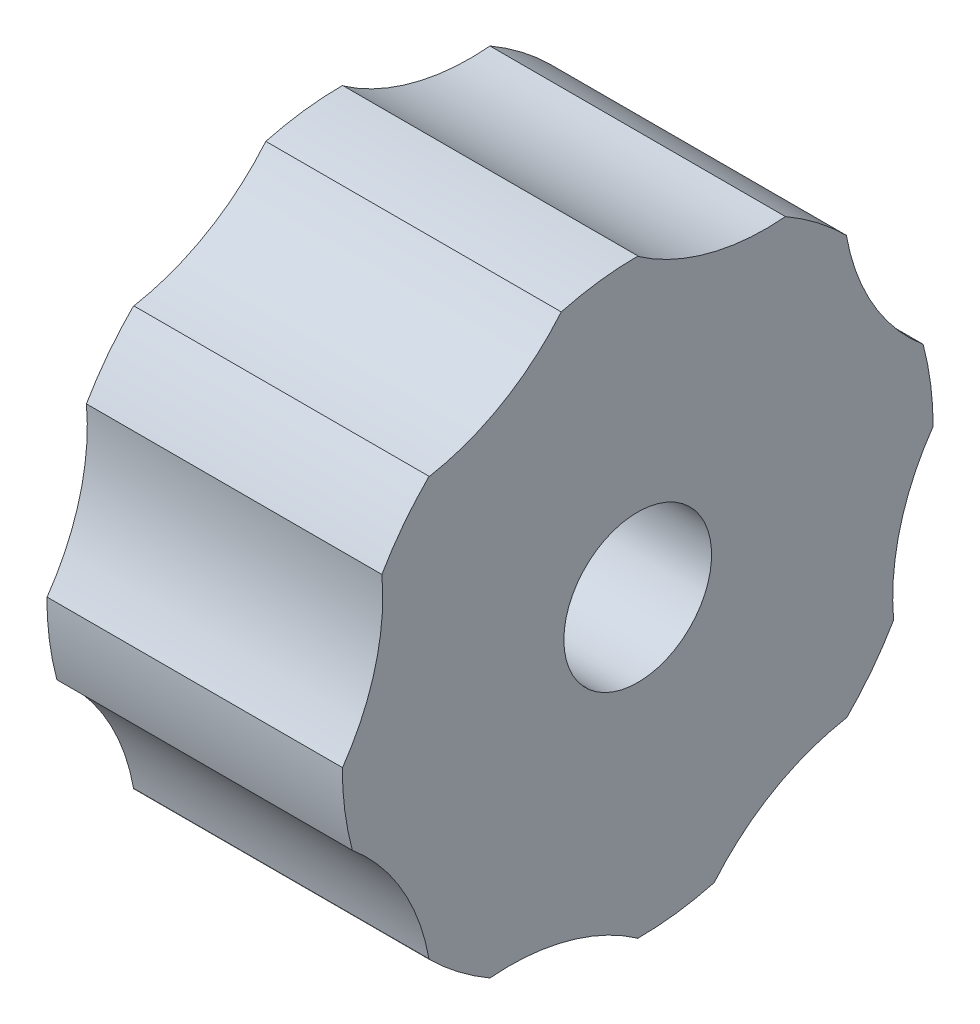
ISO-10303-21;
HEADER;
FILE_DESCRIPTION(('STEP AP214'),'2;1');
FILE_NAME('part.step','',(''),(''),'','','');
FILE_SCHEMA(('AUTOMOTIVE_DESIGN { 1 0 10303 214 1 1 1 1 }'));
ENDSEC;
DATA;
#1=APPLICATION_CONTEXT('core data for automotive mechanical design processes');
#2=APPLICATION_PROTOCOL_DEFINITION('international standard','automotive_design',2000,#1);
#3=PRODUCT_CONTEXT('',#1,'mechanical');
#4=PRODUCT('Part','Part','',(#3));
#5=PRODUCT_RELATED_PRODUCT_CATEGORY('part','',(#4));
#6=PRODUCT_DEFINITION_FORMATION('','',#4);
#7=PRODUCT_DEFINITION_CONTEXT('part definition',#1,'design');
#8=PRODUCT_DEFINITION('design','',#6,#7);
#9=PRODUCT_DEFINITION_SHAPE('','',#8);
#10=(LENGTH_UNIT() NAMED_UNIT(*) SI_UNIT(.MILLI.,.METRE.));
#11=(NAMED_UNIT(*) PLANE_ANGLE_UNIT() SI_UNIT($,.RADIAN.));
#12=(NAMED_UNIT(*) SI_UNIT($,.STERADIAN.) SOLID_ANGLE_UNIT());
#13=UNCERTAINTY_MEASURE_WITH_UNIT(LENGTH_MEASURE(1.E-05),#10,'distance_accuracy_value','');
#14=(GEOMETRIC_REPRESENTATION_CONTEXT(3) GLOBAL_UNCERTAINTY_ASSIGNED_CONTEXT((#13)) GLOBAL_UNIT_ASSIGNED_CONTEXT((#10,
#11,#12)) REPRESENTATION_CONTEXT('',''));
#15=CARTESIAN_POINT('',(0.,0.,0.));
#16=DIRECTION('',(0.,0.,1.));
#17=DIRECTION('',(1.,0.,0.));
#18=AXIS2_PLACEMENT_3D('',#15,#16,#17);
#19=CARTESIAN_POINT('',(0.,10.,0.));
#20=DIRECTION('',(-1.,0.,0.));
#21=DIRECTION('',(0.,0.,1.));
#22=AXIS2_PLACEMENT_3D('',#19,#20,#21);
#23=PLANE('',#22);
#24=CARTESIAN_POINT('',(0.,0.,0.));
#25=DIRECTION('',(-1.,0.,0.));
#26=DIRECTION('',(0.,0.,1.));
#27=AXIS2_PLACEMENT_3D('',#24,#25,#26);
#28=CIRCLE('',#27,2.5);
#29=CARTESIAN_POINT('',(0.,0.,2.5));
#30=VERTEX_POINT('',#29);
#31=EDGE_CURVE('E216',#30,#30,#28,.T.);
#32=ORIENTED_EDGE('',*,*,#31,.T.);
#33=EDGE_LOOP('',(#32));
#34=FACE_BOUND('',#33,.T.);
#35=CARTESIAN_POINT('',(0.,6.51014151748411,3.75411292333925));
#36=DIRECTION('',(1.,0.,0.));
#37=DIRECTION('',(0.,-0.707106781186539,0.707106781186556));
#38=AXIS2_PLACEMENT_3D('',#35,#36,#37);
#39=CIRCLE('',#38,3.35802196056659);
#40=CARTESIAN_POINT('',(0.,7.07842879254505,7.06369916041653));
#41=VERTEX_POINT('',#40);
#42=CARTESIAN_POINT('',(0.,7.06583669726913,7.06583669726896));
#43=VERTEX_POINT('',#42);
#44=EDGE_CURVE('E192',#41,#43,#39,.T.);
#45=ORIENTED_EDGE('',*,*,#44,.F.);
#46=CARTESIAN_POINT('',(0.,0.,0.));
#47=DIRECTION('',(-1.,0.,0.));
#48=DIRECTION('',(0.,0.,1.));
#49=AXIS2_PLACEMENT_3D('',#46,#47,#48);
#50=CIRCLE('',#49,10.);
#51=CARTESIAN_POINT('',(0.,5.0000000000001,8.66025403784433));
#52=VERTEX_POINT('',#51);
#53=EDGE_CURVE('E356',#52,#41,#50,.T.);
#54=ORIENTED_EDGE('',*,*,#53,.F.);
#55=CARTESIAN_POINT('',(0.,4.33132225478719,16.1989650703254));
#56=DIRECTION('',(1.,0.,0.));
#57=DIRECTION('',(0.,1.,0.));
#58=AXIS2_PLACEMENT_3D('',#55,#56,#57);
#59=CIRCLE('',#58,7.56830852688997);
#60=CARTESIAN_POINT('',(0.,1.03799650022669E-13,9.9926020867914));
#61=VERTEX_POINT('',#60);
#62=EDGE_CURVE('E53',#61,#52,#59,.T.);
#63=ORIENTED_EDGE('',*,*,#62,.F.);
#64=CARTESIAN_POINT('',(0.,1.94880650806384,7.25792391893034));
#65=DIRECTION('',(1.,0.,0.));
#66=DIRECTION('',(0.,-1.,0.));
#67=AXIS2_PLACEMENT_3D('',#64,#65,#66);
#68=CIRCLE('',#67,3.35802196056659);
#69=CARTESIAN_POINT('',(0.,0.0104154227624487,9.99999457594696));
#70=VERTEX_POINT('',#69);
#71=EDGE_CURVE('E218',#70,#61,#68,.T.);
#72=ORIENTED_EDGE('',*,*,#71,.F.);
#73=CARTESIAN_POINT('',(0.,-2.58819045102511,9.65925826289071));
#74=VERTEX_POINT('',#73);
#75=EDGE_CURVE('E352',#74,#70,#50,.T.);
#76=ORIENTED_EDGE('',*,*,#75,.F.);
#77=CARTESIAN_POINT('',(0.,-8.39169071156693,14.5171053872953));
#78=DIRECTION('',(1.,0.,0.));
#79=DIRECTION('',(0.,0.707106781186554,0.707106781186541));
#80=AXIS2_PLACEMENT_3D('',#77,#78,#79);
#81=CIRCLE('',#80,7.56830852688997);
#82=CARTESIAN_POINT('',(0.,-7.06583669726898,7.0658366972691));
#83=VERTEX_POINT('',#82);
#84=EDGE_CURVE('E234',#83,#74,#81,.T.);
#85=ORIENTED_EDGE('',*,*,#84,.F.);
#86=CARTESIAN_POINT('',(0.,-3.75411292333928,6.5101415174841));
#87=DIRECTION('',(1.,0.,0.));
#88=DIRECTION('',(0.,-0.707106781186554,-0.707106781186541));
#89=AXIS2_PLACEMENT_3D('',#86,#87,#88);
#90=CIRCLE('',#89,3.35802196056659);
#91=CARTESIAN_POINT('',(0.,-7.06369916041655,7.07842879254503));
#92=VERTEX_POINT('',#91);
#93=EDGE_CURVE('E232',#92,#83,#90,.T.);
#94=ORIENTED_EDGE('',*,*,#93,.F.);
#95=CARTESIAN_POINT('',(0.,-8.66025403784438,5.00000000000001));
#96=VERTEX_POINT('',#95);
#97=EDGE_CURVE('E355',#96,#92,#50,.T.);
#98=ORIENTED_EDGE('',*,*,#97,.F.);
#99=CARTESIAN_POINT('',(0.,-16.1989650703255,4.33132225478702));
#100=DIRECTION('',(1.,0.,0.));
#101=DIRECTION('',(0.,0.,1.));
#102=AXIS2_PLACEMENT_3D('',#99,#100,#101);
#103=CIRCLE('',#102,7.56830852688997);
#104=CARTESIAN_POINT('',(0.,-9.9926020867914,0.));
#105=VERTEX_POINT('',#104);
#106=EDGE_CURVE('E249',#105,#96,#103,.T.);
#107=ORIENTED_EDGE('',*,*,#106,.F.);
#108=CARTESIAN_POINT('',(0.,-7.25792391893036,1.94880650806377));
#109=DIRECTION('',(1.,0.,0.));
#110=DIRECTION('',(0.,0.,-1.));
#111=AXIS2_PLACEMENT_3D('',#108,#109,#110);
#112=CIRCLE('',#111,3.35802196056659);
#113=CARTESIAN_POINT('',(0.,-9.99999457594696,0.0104154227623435));
#114=VERTEX_POINT('',#113);
#115=EDGE_CURVE('E247',#114,#105,#112,.T.);
#116=ORIENTED_EDGE('',*,*,#115,.F.);
#117=CARTESIAN_POINT('',(0.,-9.6592582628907,-2.58819045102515));
#118=VERTEX_POINT('',#117);
#119=EDGE_CURVE('E358',#118,#114,#50,.T.);
#120=ORIENTED_EDGE('',*,*,#119,.F.);
#121=CARTESIAN_POINT('',(0.,-14.5171053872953,-8.39169071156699));
#122=DIRECTION('',(1.,0.,0.));
#123=DIRECTION('',(0.,-0.707106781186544,0.707106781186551));
#124=AXIS2_PLACEMENT_3D('',#121,#122,#123);
#125=CIRCLE('',#124,7.56830852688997);
#126=CARTESIAN_POINT('',(0.,-7.06583669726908,-7.06583669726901));
#127=VERTEX_POINT('',#126);
#128=EDGE_CURVE('E264',#127,#118,#125,.T.);
#129=ORIENTED_EDGE('',*,*,#128,.F.);
#130=CARTESIAN_POINT('',(0.,-6.51014151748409,-3.7541129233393));
#131=DIRECTION('',(1.,0.,0.));
#132=DIRECTION('',(0.,0.707106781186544,-0.707106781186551));
#133=AXIS2_PLACEMENT_3D('',#130,#131,#132);
#134=CIRCLE('',#133,3.35802196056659);
#135=CARTESIAN_POINT('',(0.,-7.07842879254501,-7.06369916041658));
#136=VERTEX_POINT('',#135);
#137=EDGE_CURVE('E262',#136,#127,#134,.T.);
#138=ORIENTED_EDGE('',*,*,#137,.F.);
#139=CARTESIAN_POINT('',(0.,-5.00000000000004,-8.66025403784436));
#140=VERTEX_POINT('',#139);
#141=EDGE_CURVE('E410',#140,#136,#50,.T.);
#142=ORIENTED_EDGE('',*,*,#141,.F.);
#143=CARTESIAN_POINT('',(0.,-4.33132225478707,-16.1989650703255));
#144=DIRECTION('',(1.,0.,0.));
#145=DIRECTION('',(0.,-1.,0.));
#146=AXIS2_PLACEMENT_3D('',#143,#144,#145);
#147=CIRCLE('',#146,7.56830852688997);
#148=CARTESIAN_POINT('',(0.,0.,-9.9926020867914));
#149=VERTEX_POINT('',#148);
#150=EDGE_CURVE('E279',#149,#140,#147,.T.);
#151=ORIENTED_EDGE('',*,*,#150,.F.);
#152=CARTESIAN_POINT('',(0.,-1.94880650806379,-7.25792391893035));
#153=DIRECTION('',(1.,0.,0.));
#154=DIRECTION('',(0.,1.,0.));
#155=AXIS2_PLACEMENT_3D('',#152,#153,#154);
#156=CIRCLE('',#155,3.35802196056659);
#157=CARTESIAN_POINT('',(0.,-0.0104154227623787,-9.99999457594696));
#158=VERTEX_POINT('',#157);
#159=EDGE_CURVE('E277',#158,#149,#156,.T.);
#160=ORIENTED_EDGE('',*,*,#159,.F.);
#161=CARTESIAN_POINT('',(0.,2.58819045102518,-9.65925826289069));
#162=VERTEX_POINT('',#161);
#163=EDGE_CURVE('E325',#162,#158,#50,.T.);
#164=ORIENTED_EDGE('',*,*,#163,.F.);
#165=CARTESIAN_POINT('',(0.,8.39169071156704,-14.5171053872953));
#166=DIRECTION('',(1.,0.,0.));
#167=DIRECTION('',(0.,-0.707106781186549,-0.707106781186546));
#168=AXIS2_PLACEMENT_3D('',#165,#166,#167);
#169=CIRCLE('',#168,7.56830852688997);
#170=CARTESIAN_POINT('',(0.,7.06583669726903,-7.06583669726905));
#171=VERTEX_POINT('',#170);
#172=EDGE_CURVE('E294',#171,#162,#169,.T.);
#173=ORIENTED_EDGE('',*,*,#172,.F.);
#174=CARTESIAN_POINT('',(0.,3.75411292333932,-6.51014151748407));
#175=DIRECTION('',(1.,0.,0.));
#176=DIRECTION('',(0.,0.707106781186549,0.707106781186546));
#177=AXIS2_PLACEMENT_3D('',#174,#175,#176);
#178=CIRCLE('',#177,3.35802196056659);
#179=CARTESIAN_POINT('',(0.,7.0636991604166,-7.07842879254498));
#180=VERTEX_POINT('',#179);
#181=EDGE_CURVE('E292',#180,#171,#178,.T.);
#182=ORIENTED_EDGE('',*,*,#181,.F.);
#183=CARTESIAN_POINT('',(0.,8.66025403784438,-5.00000000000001));
#184=VERTEX_POINT('',#183);
#185=EDGE_CURVE('E321',#184,#180,#50,.T.);
#186=ORIENTED_EDGE('',*,*,#185,.F.);
#187=CARTESIAN_POINT('',(0.,16.1989650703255,-4.33132225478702));
#188=DIRECTION('',(1.,0.,0.));
#189=DIRECTION('',(0.,0.,-1.));
#190=AXIS2_PLACEMENT_3D('',#187,#188,#189);
#191=CIRCLE('',#190,7.56830852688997);
#192=CARTESIAN_POINT('',(0.,9.9926020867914,0.));
#193=VERTEX_POINT('',#192);
#194=EDGE_CURVE('E309',#193,#184,#191,.T.);
#195=ORIENTED_EDGE('',*,*,#194,.F.);
#196=CARTESIAN_POINT('',(0.,7.25792391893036,-1.94880650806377));
#197=DIRECTION('',(1.,0.,0.));
#198=DIRECTION('',(0.,0.,1.));
#199=AXIS2_PLACEMENT_3D('',#196,#197,#198);
#200=CIRCLE('',#199,3.35802196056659);
#201=CARTESIAN_POINT('',(0.,9.99999457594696,-0.0104154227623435));
#202=VERTEX_POINT('',#201);
#203=EDGE_CURVE('E307',#202,#193,#200,.T.);
#204=ORIENTED_EDGE('',*,*,#203,.F.);
#205=CARTESIAN_POINT('',(0.,9.65925826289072,2.58819045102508));
#206=VERTEX_POINT('',#205);
#207=EDGE_CURVE('E209',#206,#202,#50,.T.);
#208=ORIENTED_EDGE('',*,*,#207,.F.);
#209=CARTESIAN_POINT('',(0.,14.5171053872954,8.39169071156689));
#210=DIRECTION('',(1.,0.,0.));
#211=DIRECTION('',(0.,0.707106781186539,-0.707106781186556));
#212=AXIS2_PLACEMENT_3D('',#209,#210,#211);
#213=CIRCLE('',#212,7.56830852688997);
#214=EDGE_CURVE('E45',#43,#206,#213,.T.);
#215=ORIENTED_EDGE('',*,*,#214,.F.);
#216=EDGE_LOOP('',(#45,#54,#63,#72,#76,#85,#94,#98,#107,#116,#120,#129,#138,#142,#151,#160,#164,
#173,#182,#186,#195,#204,#208,#215));
#217=FACE_BOUND('',#216,.T.);
#218=ADVANCED_FACE('F31',(#34,#217),#23,.F.);
#219=CARTESIAN_POINT('',(-10.,3.,0.));
#220=DIRECTION('',(1.,0.,0.));
#221=DIRECTION('',(0.,0.,-1.));
#222=AXIS2_PLACEMENT_3D('',#219,#220,#221);
#223=PLANE('',#222);
#224=CARTESIAN_POINT('',(-10.,0.,0.));
#225=DIRECTION('',(-1.,0.,0.));
#226=DIRECTION('',(0.,0.,1.));
#227=AXIS2_PLACEMENT_3D('',#224,#225,#226);
#228=CIRCLE('',#227,2.5);
#229=CARTESIAN_POINT('',(-10.,0.,2.5));
#230=VERTEX_POINT('',#229);
#231=EDGE_CURVE('E468',#230,#230,#228,.T.);
#232=ORIENTED_EDGE('',*,*,#231,.F.);
#233=EDGE_LOOP('',(#232));
#234=FACE_BOUND('',#233,.T.);
#235=CARTESIAN_POINT('',(-10.,6.51014151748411,3.75411292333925));
#236=DIRECTION('',(1.,0.,0.));
#237=DIRECTION('',(0.,-0.707106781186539,0.707106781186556));
#238=AXIS2_PLACEMENT_3D('',#235,#236,#237);
#239=CIRCLE('',#238,3.35802196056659);
#240=CARTESIAN_POINT('',(-10.,7.07842879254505,7.06369916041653));
#241=VERTEX_POINT('',#240);
#242=CARTESIAN_POINT('',(-10.,7.06583669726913,7.06583669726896));
#243=VERTEX_POINT('',#242);
#244=EDGE_CURVE('E214',#241,#243,#239,.T.);
#245=ORIENTED_EDGE('',*,*,#244,.T.);
#246=CARTESIAN_POINT('',(-10.,14.5171053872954,8.39169071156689));
#247=DIRECTION('',(1.,0.,0.));
#248=DIRECTION('',(0.,0.707106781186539,-0.707106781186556));
#249=AXIS2_PLACEMENT_3D('',#246,#247,#248);
#250=CIRCLE('',#249,7.56830852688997);
#251=CARTESIAN_POINT('',(-10.,9.65925826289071,2.58819045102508));
#252=VERTEX_POINT('',#251);
#253=EDGE_CURVE('E200',#243,#252,#250,.T.);
#254=ORIENTED_EDGE('',*,*,#253,.T.);
#255=CARTESIAN_POINT('',(-10.,0.,0.));
#256=DIRECTION('',(-1.,0.,0.));
#257=DIRECTION('',(0.,0.,1.));
#258=AXIS2_PLACEMENT_3D('',#255,#256,#257);
#259=CIRCLE('',#258,10.);
#260=CARTESIAN_POINT('',(-10.,9.99999457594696,-0.0104154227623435));
#261=VERTEX_POINT('',#260);
#262=EDGE_CURVE('E324',#252,#261,#259,.T.);
#263=ORIENTED_EDGE('',*,*,#262,.T.);
#264=CARTESIAN_POINT('',(-10.,7.25792391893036,-1.94880650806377));
#265=DIRECTION('',(1.,0.,0.));
#266=DIRECTION('',(0.,0.,1.));
#267=AXIS2_PLACEMENT_3D('',#264,#265,#266);
#268=CIRCLE('',#267,3.35802196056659);
#269=CARTESIAN_POINT('',(-10.,9.9926020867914,0.));
#270=VERTEX_POINT('',#269);
#271=EDGE_CURVE('E306',#261,#270,#268,.T.);
#272=ORIENTED_EDGE('',*,*,#271,.T.);
#273=CARTESIAN_POINT('',(-10.,16.1989650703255,-4.33132225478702));
#274=DIRECTION('',(1.,0.,0.));
#275=DIRECTION('',(0.,0.,-1.));
#276=AXIS2_PLACEMENT_3D('',#273,#274,#275);
#277=CIRCLE('',#276,7.56830852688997);
#278=CARTESIAN_POINT('',(-10.,8.66025403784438,-5.00000000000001));
#279=VERTEX_POINT('',#278);
#280=EDGE_CURVE('E310',#270,#279,#277,.T.);
#281=ORIENTED_EDGE('',*,*,#280,.T.);
#282=CARTESIAN_POINT('',(-10.,7.0636991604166,-7.07842879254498));
#283=VERTEX_POINT('',#282);
#284=EDGE_CURVE('E326',#279,#283,#259,.T.);
#285=ORIENTED_EDGE('',*,*,#284,.T.);
#286=CARTESIAN_POINT('',(-10.,3.75411292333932,-6.51014151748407));
#287=DIRECTION('',(1.,0.,0.));
#288=DIRECTION('',(0.,0.707106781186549,0.707106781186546));
#289=AXIS2_PLACEMENT_3D('',#286,#287,#288);
#290=CIRCLE('',#289,3.35802196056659);
#291=CARTESIAN_POINT('',(-10.,7.06583669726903,-7.06583669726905));
#292=VERTEX_POINT('',#291);
#293=EDGE_CURVE('E291',#283,#292,#290,.T.);
#294=ORIENTED_EDGE('',*,*,#293,.T.);
#295=CARTESIAN_POINT('',(-10.,8.39169071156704,-14.5171053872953));
#296=DIRECTION('',(1.,0.,0.));
#297=DIRECTION('',(0.,-0.707106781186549,-0.707106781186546));
#298=AXIS2_PLACEMENT_3D('',#295,#296,#297);
#299=CIRCLE('',#298,7.56830852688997);
#300=CARTESIAN_POINT('',(-10.,2.58819045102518,-9.65925826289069));
#301=VERTEX_POINT('',#300);
#302=EDGE_CURVE('E295',#292,#301,#299,.T.);
#303=ORIENTED_EDGE('',*,*,#302,.T.);
#304=CARTESIAN_POINT('',(-10.,-0.0104154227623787,-9.99999457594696));
#305=VERTEX_POINT('',#304);
#306=EDGE_CURVE('E330',#301,#305,#259,.T.);
#307=ORIENTED_EDGE('',*,*,#306,.T.);
#308=CARTESIAN_POINT('',(-10.,-1.94880650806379,-7.25792391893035));
#309=DIRECTION('',(1.,0.,0.));
#310=DIRECTION('',(0.,1.,0.));
#311=AXIS2_PLACEMENT_3D('',#308,#309,#310);
#312=CIRCLE('',#311,3.35802196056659);
#313=CARTESIAN_POINT('',(-10.,0.,-9.9926020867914));
#314=VERTEX_POINT('',#313);
#315=EDGE_CURVE('E276',#305,#314,#312,.T.);
#316=ORIENTED_EDGE('',*,*,#315,.T.);
#317=CARTESIAN_POINT('',(-10.,-4.33132225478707,-16.1989650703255));
#318=DIRECTION('',(1.,0.,0.));
#319=DIRECTION('',(0.,-1.,0.));
#320=AXIS2_PLACEMENT_3D('',#317,#318,#319);
#321=CIRCLE('',#320,7.56830852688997);
#322=CARTESIAN_POINT('',(-10.,-5.00000000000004,-8.66025403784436));
#323=VERTEX_POINT('',#322);
#324=EDGE_CURVE('E280',#314,#323,#321,.T.);
#325=ORIENTED_EDGE('',*,*,#324,.T.);
#326=CARTESIAN_POINT('',(-10.,-7.07842879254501,-7.06369916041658));
#327=VERTEX_POINT('',#326);
#328=EDGE_CURVE('E389',#323,#327,#259,.T.);
#329=ORIENTED_EDGE('',*,*,#328,.T.);
#330=CARTESIAN_POINT('',(-10.,-6.51014151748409,-3.7541129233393));
#331=DIRECTION('',(1.,0.,0.));
#332=DIRECTION('',(0.,0.707106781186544,-0.707106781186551));
#333=AXIS2_PLACEMENT_3D('',#330,#331,#332);
#334=CIRCLE('',#333,3.35802196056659);
#335=CARTESIAN_POINT('',(-10.,-7.06583669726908,-7.06583669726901));
#336=VERTEX_POINT('',#335);
#337=EDGE_CURVE('E261',#327,#336,#334,.T.);
#338=ORIENTED_EDGE('',*,*,#337,.T.);
#339=CARTESIAN_POINT('',(-10.,-14.5171053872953,-8.39169071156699));
#340=DIRECTION('',(1.,0.,0.));
#341=DIRECTION('',(0.,-0.707106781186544,0.707106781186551));
#342=AXIS2_PLACEMENT_3D('',#339,#340,#341);
#343=CIRCLE('',#342,7.56830852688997);
#344=CARTESIAN_POINT('',(-10.,-9.6592582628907,-2.58819045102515));
#345=VERTEX_POINT('',#344);
#346=EDGE_CURVE('E265',#336,#345,#343,.T.);
#347=ORIENTED_EDGE('',*,*,#346,.T.);
#348=CARTESIAN_POINT('',(-10.,-9.99999457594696,0.0104154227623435));
#349=VERTEX_POINT('',#348);
#350=EDGE_CURVE('E386',#345,#349,#259,.T.);
#351=ORIENTED_EDGE('',*,*,#350,.T.);
#352=CARTESIAN_POINT('',(-10.,-7.25792391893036,1.94880650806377));
#353=DIRECTION('',(1.,0.,0.));
#354=DIRECTION('',(0.,0.,-1.));
#355=AXIS2_PLACEMENT_3D('',#352,#353,#354);
#356=CIRCLE('',#355,3.35802196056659);
#357=CARTESIAN_POINT('',(-10.,-9.9926020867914,0.));
#358=VERTEX_POINT('',#357);
#359=EDGE_CURVE('E246',#349,#358,#356,.T.);
#360=ORIENTED_EDGE('',*,*,#359,.T.);
#361=CARTESIAN_POINT('',(-10.,-16.1989650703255,4.33132225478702));
#362=DIRECTION('',(1.,0.,0.));
#363=DIRECTION('',(0.,0.,1.));
#364=AXIS2_PLACEMENT_3D('',#361,#362,#363);
#365=CIRCLE('',#364,7.56830852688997);
#366=CARTESIAN_POINT('',(-10.,-8.66025403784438,5.00000000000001));
#367=VERTEX_POINT('',#366);
#368=EDGE_CURVE('E250',#358,#367,#365,.T.);
#369=ORIENTED_EDGE('',*,*,#368,.T.);
#370=CARTESIAN_POINT('',(-10.,-7.06369916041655,7.07842879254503));
#371=VERTEX_POINT('',#370);
#372=EDGE_CURVE('E384',#367,#371,#259,.T.);
#373=ORIENTED_EDGE('',*,*,#372,.T.);
#374=CARTESIAN_POINT('',(-10.,-3.75411292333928,6.5101415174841));
#375=DIRECTION('',(1.,0.,0.));
#376=DIRECTION('',(0.,-0.707106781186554,-0.707106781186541));
#377=AXIS2_PLACEMENT_3D('',#374,#375,#376);
#378=CIRCLE('',#377,3.35802196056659);
#379=CARTESIAN_POINT('',(-10.,-7.06583669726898,7.0658366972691));
#380=VERTEX_POINT('',#379);
#381=EDGE_CURVE('E231',#371,#380,#378,.T.);
#382=ORIENTED_EDGE('',*,*,#381,.T.);
#383=CARTESIAN_POINT('',(-10.,-8.39169071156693,14.5171053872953));
#384=DIRECTION('',(1.,0.,0.));
#385=DIRECTION('',(0.,0.707106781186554,0.707106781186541));
#386=AXIS2_PLACEMENT_3D('',#383,#384,#385);
#387=CIRCLE('',#386,7.56830852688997);
#388=CARTESIAN_POINT('',(-10.,-2.58819045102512,9.65925826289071));
#389=VERTEX_POINT('',#388);
#390=EDGE_CURVE('E235',#380,#389,#387,.T.);
#391=ORIENTED_EDGE('',*,*,#390,.T.);
#392=CARTESIAN_POINT('',(-10.,0.0104154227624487,9.99999457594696));
#393=VERTEX_POINT('',#392);
#394=EDGE_CURVE('E382',#389,#393,#259,.T.);
#395=ORIENTED_EDGE('',*,*,#394,.T.);
#396=CARTESIAN_POINT('',(-10.,1.94880650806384,7.25792391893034));
#397=DIRECTION('',(1.,0.,0.));
#398=DIRECTION('',(0.,-1.,0.));
#399=AXIS2_PLACEMENT_3D('',#396,#397,#398);
#400=CIRCLE('',#399,3.35802196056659);
#401=CARTESIAN_POINT('',(-10.,1.03799650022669E-13,9.9926020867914));
#402=VERTEX_POINT('',#401);
#403=EDGE_CURVE('E204',#393,#402,#400,.T.);
#404=ORIENTED_EDGE('',*,*,#403,.T.);
#405=CARTESIAN_POINT('',(-10.,4.33132225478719,16.1989650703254));
#406=DIRECTION('',(1.,0.,0.));
#407=DIRECTION('',(0.,1.,0.));
#408=AXIS2_PLACEMENT_3D('',#405,#406,#407);
#409=CIRCLE('',#408,7.56830852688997);
#410=CARTESIAN_POINT('',(-10.,5.0000000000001,8.66025403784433));
#411=VERTEX_POINT('',#410);
#412=EDGE_CURVE('E220',#402,#411,#409,.T.);
#413=ORIENTED_EDGE('',*,*,#412,.T.);
#414=EDGE_CURVE('E380',#411,#241,#259,.T.);
#415=ORIENTED_EDGE('',*,*,#414,.T.);
#416=EDGE_LOOP('',(#245,#254,#263,#272,#281,#285,#294,#303,#307,#316,#325,#329,#338,#347,#351,
#360,#369,#373,#382,#391,#395,#404,#413,#415));
#417=FACE_BOUND('',#416,.T.);
#418=ADVANCED_FACE('F379',(#234,#417),#223,.F.);
#419=CARTESIAN_POINT('',(0.,0.,0.));
#420=DIRECTION('',(-1.,0.,0.));
#421=DIRECTION('',(0.,0.,1.));
#422=AXIS2_PLACEMENT_3D('',#419,#420,#421);
#423=CYLINDRICAL_SURFACE('',#422,10.);
#424=DIRECTION('',(-1.,0.,0.));
#425=VECTOR('',#424,1.);
#426=CARTESIAN_POINT('',(-5.,7.07842879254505,7.06369916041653));
#427=LINE('',#426,#425);
#428=EDGE_CURVE('E11',#241,#41,#427,.F.);
#429=ORIENTED_EDGE('',*,*,#428,.F.);
#430=ORIENTED_EDGE('',*,*,#414,.F.);
#431=DIRECTION('',(-1.,0.,0.));
#432=VECTOR('',#431,1.);
#433=CARTESIAN_POINT('',(0.,5.0000000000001,8.66025403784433));
#434=LINE('',#433,#432);
#435=EDGE_CURVE('E222',#52,#411,#434,.T.);
#436=ORIENTED_EDGE('',*,*,#435,.F.);
#437=ORIENTED_EDGE('',*,*,#53,.T.);
#438=EDGE_LOOP('',(#429,#430,#436,#437));
#439=FACE_BOUND('',#438,.T.);
#440=ADVANCED_FACE('F463',(#439),#423,.T.);
#441=DIRECTION('',(-1.,0.,0.));
#442=VECTOR('',#441,1.);
#443=CARTESIAN_POINT('',(0.,9.65925826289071,2.58819045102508));
#444=LINE('',#443,#442);
#445=EDGE_CURVE('E205',#206,#252,#444,.T.);
#446=ORIENTED_EDGE('',*,*,#445,.F.);
#447=ORIENTED_EDGE('',*,*,#207,.T.);
#448=DIRECTION('',(-1.,0.,0.));
#449=VECTOR('',#448,1.);
#450=CARTESIAN_POINT('',(-5.,9.99999457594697,-0.0104154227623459));
#451=LINE('',#450,#449);
#452=EDGE_CURVE('E329',#261,#202,#451,.F.);
#453=ORIENTED_EDGE('',*,*,#452,.F.);
#454=ORIENTED_EDGE('',*,*,#262,.F.);
#455=EDGE_LOOP('',(#446,#447,#453,#454));
#456=FACE_BOUND('',#455,.T.);
#457=ADVANCED_FACE('F362',(#456),#423,.T.);
#458=DIRECTION('',(-1.,0.,0.));
#459=VECTOR('',#458,1.);
#460=CARTESIAN_POINT('',(-5.,0.0104154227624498,9.99999457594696));
#461=LINE('',#460,#459);
#462=EDGE_CURVE('E38',#393,#70,#461,.F.);
#463=ORIENTED_EDGE('',*,*,#462,.F.);
#464=ORIENTED_EDGE('',*,*,#394,.F.);
#465=DIRECTION('',(-1.,0.,0.));
#466=VECTOR('',#465,1.);
#467=CARTESIAN_POINT('',(0.,-2.58819045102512,9.65925826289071));
#468=LINE('',#467,#466);
#469=EDGE_CURVE('E237',#74,#389,#468,.T.);
#470=ORIENTED_EDGE('',*,*,#469,.F.);
#471=ORIENTED_EDGE('',*,*,#75,.T.);
#472=EDGE_LOOP('',(#463,#464,#470,#471));
#473=FACE_BOUND('',#472,.T.);
#474=ADVANCED_FACE('F354',(#473),#423,.T.);
#475=DIRECTION('',(-1.,0.,0.));
#476=VECTOR('',#475,1.);
#477=CARTESIAN_POINT('',(-5.,-7.06369916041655,7.07842879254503));
#478=LINE('',#477,#476);
#479=EDGE_CURVE('E341',#371,#92,#478,.F.);
#480=ORIENTED_EDGE('',*,*,#479,.F.);
#481=ORIENTED_EDGE('',*,*,#372,.F.);
#482=DIRECTION('',(-1.,0.,0.));
#483=VECTOR('',#482,1.);
#484=CARTESIAN_POINT('',(0.,-8.66025403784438,5.00000000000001));
#485=LINE('',#484,#483);
#486=EDGE_CURVE('E252',#96,#367,#485,.T.);
#487=ORIENTED_EDGE('',*,*,#486,.F.);
#488=ORIENTED_EDGE('',*,*,#97,.T.);
#489=EDGE_LOOP('',(#480,#481,#487,#488));
#490=FACE_BOUND('',#489,.T.);
#491=ADVANCED_FACE('F441',(#490),#423,.T.);
#492=DIRECTION('',(-1.,0.,0.));
#493=VECTOR('',#492,1.);
#494=CARTESIAN_POINT('',(-5.,-9.99999457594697,0.0104154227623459));
#495=LINE('',#494,#493);
#496=EDGE_CURVE('E339',#349,#114,#495,.F.);
#497=ORIENTED_EDGE('',*,*,#496,.F.);
#498=ORIENTED_EDGE('',*,*,#350,.F.);
#499=DIRECTION('',(-1.,0.,0.));
#500=VECTOR('',#499,1.);
#501=CARTESIAN_POINT('',(0.,-9.6592582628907,-2.58819045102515));
#502=LINE('',#501,#500);
#503=EDGE_CURVE('E267',#118,#345,#502,.T.);
#504=ORIENTED_EDGE('',*,*,#503,.F.);
#505=ORIENTED_EDGE('',*,*,#119,.T.);
#506=EDGE_LOOP('',(#497,#498,#504,#505));
#507=FACE_BOUND('',#506,.T.);
#508=ADVANCED_FACE('F429',(#507),#423,.T.);
#509=DIRECTION('',(-1.,0.,0.));
#510=VECTOR('',#509,1.);
#511=CARTESIAN_POINT('',(-5.,-7.078428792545,-7.06369916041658));
#512=LINE('',#511,#510);
#513=EDGE_CURVE('E337',#327,#136,#512,.F.);
#514=ORIENTED_EDGE('',*,*,#513,.F.);
#515=ORIENTED_EDGE('',*,*,#328,.F.);
#516=DIRECTION('',(-1.,0.,0.));
#517=VECTOR('',#516,1.);
#518=CARTESIAN_POINT('',(0.,-5.00000000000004,-8.66025403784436));
#519=LINE('',#518,#517);
#520=EDGE_CURVE('E282',#140,#323,#519,.T.);
#521=ORIENTED_EDGE('',*,*,#520,.F.);
#522=ORIENTED_EDGE('',*,*,#141,.T.);
#523=EDGE_LOOP('',(#514,#515,#521,#522));
#524=FACE_BOUND('',#523,.T.);
#525=ADVANCED_FACE('F416',(#524),#423,.T.);
#526=DIRECTION('',(-1.,0.,0.));
#527=VECTOR('',#526,1.);
#528=CARTESIAN_POINT('',(-5.,-0.0104154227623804,-9.99999457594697));
#529=LINE('',#528,#527);
#530=EDGE_CURVE('E335',#305,#158,#529,.F.);
#531=ORIENTED_EDGE('',*,*,#530,.F.);
#532=ORIENTED_EDGE('',*,*,#306,.F.);
#533=DIRECTION('',(-1.,0.,0.));
#534=VECTOR('',#533,1.);
#535=CARTESIAN_POINT('',(0.,2.58819045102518,-9.65925826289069));
#536=LINE('',#535,#534);
#537=EDGE_CURVE('E297',#162,#301,#536,.T.);
#538=ORIENTED_EDGE('',*,*,#537,.F.);
#539=ORIENTED_EDGE('',*,*,#163,.T.);
#540=EDGE_LOOP('',(#531,#532,#538,#539));
#541=FACE_BOUND('',#540,.T.);
#542=ADVANCED_FACE('F398',(#541),#423,.T.);
#543=DIRECTION('',(-1.,0.,0.));
#544=VECTOR('',#543,1.);
#545=CARTESIAN_POINT('',(-5.,7.0636991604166,-7.07842879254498));
#546=LINE('',#545,#544);
#547=EDGE_CURVE('E333',#283,#180,#546,.F.);
#548=ORIENTED_EDGE('',*,*,#547,.F.);
#549=ORIENTED_EDGE('',*,*,#284,.F.);
#550=DIRECTION('',(-1.,0.,0.));
#551=VECTOR('',#550,1.);
#552=CARTESIAN_POINT('',(0.,8.66025403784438,-5.00000000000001));
#553=LINE('',#552,#551);
#554=EDGE_CURVE('E312',#184,#279,#553,.T.);
#555=ORIENTED_EDGE('',*,*,#554,.F.);
#556=ORIENTED_EDGE('',*,*,#185,.T.);
#557=EDGE_LOOP('',(#548,#549,#555,#556));
#558=FACE_BOUND('',#557,.T.);
#559=ADVANCED_FACE('F377',(#558),#423,.T.);
#560=CARTESIAN_POINT('',(0.,7.25792391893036,-1.94880650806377));
#561=DIRECTION('',(-1.,0.,0.));
#562=DIRECTION('',(0.,0.,1.));
#563=AXIS2_PLACEMENT_3D('',#560,#561,#562);
#564=CYLINDRICAL_SURFACE('',#563,3.35802196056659);
#565=ORIENTED_EDGE('',*,*,#452,.T.);
#566=ORIENTED_EDGE('',*,*,#203,.T.);
#567=DIRECTION('',(-1.,0.,0.));
#568=VECTOR('',#567,1.);
#569=CARTESIAN_POINT('',(0.,9.9926020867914,0.));
#570=LINE('',#569,#568);
#571=EDGE_CURVE('E318',#193,#270,#570,.T.);
#572=ORIENTED_EDGE('',*,*,#571,.T.);
#573=ORIENTED_EDGE('',*,*,#271,.F.);
#574=EDGE_LOOP('',(#565,#566,#572,#573));
#575=FACE_BOUND('',#574,.T.);
#576=ADVANCED_FACE('F366',(#575),#564,.F.);
#577=CARTESIAN_POINT('',(0.,16.1989650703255,-4.33132225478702));
#578=DIRECTION('',(-1.,0.,0.));
#579=DIRECTION('',(0.,0.,1.));
#580=AXIS2_PLACEMENT_3D('',#577,#578,#579);
#581=CYLINDRICAL_SURFACE('',#580,7.56830852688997);
#582=ORIENTED_EDGE('',*,*,#280,.F.);
#583=ORIENTED_EDGE('',*,*,#571,.F.);
#584=ORIENTED_EDGE('',*,*,#194,.T.);
#585=ORIENTED_EDGE('',*,*,#554,.T.);
#586=EDGE_LOOP('',(#582,#583,#584,#585));
#587=FACE_BOUND('',#586,.T.);
#588=ADVANCED_FACE('F373',(#587),#581,.F.);
#589=CARTESIAN_POINT('',(0.,3.75411292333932,-6.51014151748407));
#590=DIRECTION('',(-1.,0.,0.));
#591=DIRECTION('',(0.,0.,1.));
#592=AXIS2_PLACEMENT_3D('',#589,#590,#591);
#593=CYLINDRICAL_SURFACE('',#592,3.35802196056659);
#594=ORIENTED_EDGE('',*,*,#547,.T.);
#595=ORIENTED_EDGE('',*,*,#181,.T.);
#596=DIRECTION('',(-1.,0.,0.));
#597=VECTOR('',#596,1.);
#598=CARTESIAN_POINT('',(0.,7.06583669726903,-7.06583669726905));
#599=LINE('',#598,#597);
#600=EDGE_CURVE('E303',#171,#292,#599,.T.);
#601=ORIENTED_EDGE('',*,*,#600,.T.);
#602=ORIENTED_EDGE('',*,*,#293,.F.);
#603=EDGE_LOOP('',(#594,#595,#601,#602));
#604=FACE_BOUND('',#603,.T.);
#605=ADVANCED_FACE('F529',(#604),#593,.F.);
#606=CARTESIAN_POINT('',(0.,8.39169071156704,-14.5171053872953));
#607=DIRECTION('',(-1.,0.,0.));
#608=DIRECTION('',(0.,0.,1.));
#609=AXIS2_PLACEMENT_3D('',#606,#607,#608);
#610=CYLINDRICAL_SURFACE('',#609,7.56830852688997);
#611=ORIENTED_EDGE('',*,*,#302,.F.);
#612=ORIENTED_EDGE('',*,*,#600,.F.);
#613=ORIENTED_EDGE('',*,*,#172,.T.);
#614=ORIENTED_EDGE('',*,*,#537,.T.);
#615=EDGE_LOOP('',(#611,#612,#613,#614));
#616=FACE_BOUND('',#615,.T.);
#617=ADVANCED_FACE('F544',(#616),#610,.F.);
#618=CARTESIAN_POINT('',(0.,-1.94880650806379,-7.25792391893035));
#619=DIRECTION('',(-1.,0.,0.));
#620=DIRECTION('',(0.,0.,1.));
#621=AXIS2_PLACEMENT_3D('',#618,#619,#620);
#622=CYLINDRICAL_SURFACE('',#621,3.35802196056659);
#623=ORIENTED_EDGE('',*,*,#530,.T.);
#624=ORIENTED_EDGE('',*,*,#159,.T.);
#625=DIRECTION('',(-1.,0.,0.));
#626=VECTOR('',#625,1.);
#627=CARTESIAN_POINT('',(0.,0.,-9.9926020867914));
#628=LINE('',#627,#626);
#629=EDGE_CURVE('E288',#149,#314,#628,.T.);
#630=ORIENTED_EDGE('',*,*,#629,.T.);
#631=ORIENTED_EDGE('',*,*,#315,.F.);
#632=EDGE_LOOP('',(#623,#624,#630,#631));
#633=FACE_BOUND('',#632,.T.);
#634=ADVANCED_FACE('F403',(#633),#622,.F.);
#635=CARTESIAN_POINT('',(0.,-4.33132225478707,-16.1989650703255));
#636=DIRECTION('',(-1.,0.,0.));
#637=DIRECTION('',(0.,0.,1.));
#638=AXIS2_PLACEMENT_3D('',#635,#636,#637);
#639=CYLINDRICAL_SURFACE('',#638,7.56830852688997);
#640=ORIENTED_EDGE('',*,*,#324,.F.);
#641=ORIENTED_EDGE('',*,*,#629,.F.);
#642=ORIENTED_EDGE('',*,*,#150,.T.);
#643=ORIENTED_EDGE('',*,*,#520,.T.);
#644=EDGE_LOOP('',(#640,#641,#642,#643));
#645=FACE_BOUND('',#644,.T.);
#646=ADVANCED_FACE('F413',(#645),#639,.F.);
#647=CARTESIAN_POINT('',(0.,-6.51014151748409,-3.7541129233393));
#648=DIRECTION('',(-1.,0.,0.));
#649=DIRECTION('',(0.,0.,1.));
#650=AXIS2_PLACEMENT_3D('',#647,#648,#649);
#651=CYLINDRICAL_SURFACE('',#650,3.35802196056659);
#652=ORIENTED_EDGE('',*,*,#513,.T.);
#653=ORIENTED_EDGE('',*,*,#137,.T.);
#654=DIRECTION('',(-1.,0.,0.));
#655=VECTOR('',#654,1.);
#656=CARTESIAN_POINT('',(0.,-7.06583669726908,-7.06583669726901));
#657=LINE('',#656,#655);
#658=EDGE_CURVE('E273',#127,#336,#657,.T.);
#659=ORIENTED_EDGE('',*,*,#658,.T.);
#660=ORIENTED_EDGE('',*,*,#337,.F.);
#661=EDGE_LOOP('',(#652,#653,#659,#660));
#662=FACE_BOUND('',#661,.T.);
#663=ADVANCED_FACE('F418',(#662),#651,.F.);
#664=CARTESIAN_POINT('',(0.,-14.5171053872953,-8.39169071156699));
#665=DIRECTION('',(-1.,0.,0.));
#666=DIRECTION('',(0.,0.,1.));
#667=AXIS2_PLACEMENT_3D('',#664,#665,#666);
#668=CYLINDRICAL_SURFACE('',#667,7.56830852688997);
#669=ORIENTED_EDGE('',*,*,#346,.F.);
#670=ORIENTED_EDGE('',*,*,#658,.F.);
#671=ORIENTED_EDGE('',*,*,#128,.T.);
#672=ORIENTED_EDGE('',*,*,#503,.T.);
#673=EDGE_LOOP('',(#669,#670,#671,#672));
#674=FACE_BOUND('',#673,.T.);
#675=ADVANCED_FACE('F426',(#674),#668,.F.);
#676=CARTESIAN_POINT('',(0.,-7.25792391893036,1.94880650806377));
#677=DIRECTION('',(-1.,0.,0.));
#678=DIRECTION('',(0.,0.,1.));
#679=AXIS2_PLACEMENT_3D('',#676,#677,#678);
#680=CYLINDRICAL_SURFACE('',#679,3.35802196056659);
#681=ORIENTED_EDGE('',*,*,#496,.T.);
#682=ORIENTED_EDGE('',*,*,#115,.T.);
#683=DIRECTION('',(-1.,0.,0.));
#684=VECTOR('',#683,1.);
#685=CARTESIAN_POINT('',(0.,-9.9926020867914,0.));
#686=LINE('',#685,#684);
#687=EDGE_CURVE('E258',#105,#358,#686,.T.);
#688=ORIENTED_EDGE('',*,*,#687,.T.);
#689=ORIENTED_EDGE('',*,*,#359,.F.);
#690=EDGE_LOOP('',(#681,#682,#688,#689));
#691=FACE_BOUND('',#690,.T.);
#692=ADVANCED_FACE('F431',(#691),#680,.F.);
#693=CARTESIAN_POINT('',(0.,-16.1989650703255,4.33132225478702));
#694=DIRECTION('',(-1.,0.,0.));
#695=DIRECTION('',(0.,0.,1.));
#696=AXIS2_PLACEMENT_3D('',#693,#694,#695);
#697=CYLINDRICAL_SURFACE('',#696,7.56830852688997);
#698=ORIENTED_EDGE('',*,*,#368,.F.);
#699=ORIENTED_EDGE('',*,*,#687,.F.);
#700=ORIENTED_EDGE('',*,*,#106,.T.);
#701=ORIENTED_EDGE('',*,*,#486,.T.);
#702=EDGE_LOOP('',(#698,#699,#700,#701));
#703=FACE_BOUND('',#702,.T.);
#704=ADVANCED_FACE('F438',(#703),#697,.F.);
#705=CARTESIAN_POINT('',(0.,-3.75411292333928,6.5101415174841));
#706=DIRECTION('',(-1.,0.,0.));
#707=DIRECTION('',(0.,0.,1.));
#708=AXIS2_PLACEMENT_3D('',#705,#706,#707);
#709=CYLINDRICAL_SURFACE('',#708,3.35802196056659);
#710=ORIENTED_EDGE('',*,*,#479,.T.);
#711=ORIENTED_EDGE('',*,*,#93,.T.);
#712=DIRECTION('',(-1.,0.,0.));
#713=VECTOR('',#712,1.);
#714=CARTESIAN_POINT('',(0.,-7.06583669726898,7.0658366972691));
#715=LINE('',#714,#713);
#716=EDGE_CURVE('E243',#83,#380,#715,.T.);
#717=ORIENTED_EDGE('',*,*,#716,.T.);
#718=ORIENTED_EDGE('',*,*,#381,.F.);
#719=EDGE_LOOP('',(#710,#711,#717,#718));
#720=FACE_BOUND('',#719,.T.);
#721=ADVANCED_FACE('F443',(#720),#709,.F.);
#722=CARTESIAN_POINT('',(0.,-8.39169071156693,14.5171053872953));
#723=DIRECTION('',(-1.,0.,0.));
#724=DIRECTION('',(0.,0.,1.));
#725=AXIS2_PLACEMENT_3D('',#722,#723,#724);
#726=CYLINDRICAL_SURFACE('',#725,7.56830852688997);
#727=ORIENTED_EDGE('',*,*,#390,.F.);
#728=ORIENTED_EDGE('',*,*,#716,.F.);
#729=ORIENTED_EDGE('',*,*,#84,.T.);
#730=ORIENTED_EDGE('',*,*,#469,.T.);
#731=EDGE_LOOP('',(#727,#728,#729,#730));
#732=FACE_BOUND('',#731,.T.);
#733=ADVANCED_FACE('F446',(#732),#726,.F.);
#734=CARTESIAN_POINT('',(0.,1.94880650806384,7.25792391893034));
#735=DIRECTION('',(-1.,0.,0.));
#736=DIRECTION('',(0.,0.,1.));
#737=AXIS2_PLACEMENT_3D('',#734,#735,#736);
#738=CYLINDRICAL_SURFACE('',#737,3.35802196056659);
#739=ORIENTED_EDGE('',*,*,#462,.T.);
#740=ORIENTED_EDGE('',*,*,#71,.T.);
#741=DIRECTION('',(-1.,0.,0.));
#742=VECTOR('',#741,1.);
#743=CARTESIAN_POINT('',(0.,1.03799650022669E-13,9.9926020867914));
#744=LINE('',#743,#742);
#745=EDGE_CURVE('E228',#61,#402,#744,.T.);
#746=ORIENTED_EDGE('',*,*,#745,.T.);
#747=ORIENTED_EDGE('',*,*,#403,.F.);
#748=EDGE_LOOP('',(#739,#740,#746,#747));
#749=FACE_BOUND('',#748,.T.);
#750=ADVANCED_FACE('F345',(#749),#738,.F.);
#751=CARTESIAN_POINT('',(0.,4.33132225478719,16.1989650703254));
#752=DIRECTION('',(-1.,0.,0.));
#753=DIRECTION('',(0.,0.,1.));
#754=AXIS2_PLACEMENT_3D('',#751,#752,#753);
#755=CYLINDRICAL_SURFACE('',#754,7.56830852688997);
#756=ORIENTED_EDGE('',*,*,#412,.F.);
#757=ORIENTED_EDGE('',*,*,#745,.F.);
#758=ORIENTED_EDGE('',*,*,#62,.T.);
#759=ORIENTED_EDGE('',*,*,#435,.T.);
#760=EDGE_LOOP('',(#756,#757,#758,#759));
#761=FACE_BOUND('',#760,.T.);
#762=ADVANCED_FACE('F453',(#761),#755,.F.);
#763=CARTESIAN_POINT('',(0.,6.51014151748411,3.75411292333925));
#764=DIRECTION('',(-1.,0.,0.));
#765=DIRECTION('',(0.,0.,1.));
#766=AXIS2_PLACEMENT_3D('',#763,#764,#765);
#767=CYLINDRICAL_SURFACE('',#766,3.35802196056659);
#768=ORIENTED_EDGE('',*,*,#428,.T.);
#769=ORIENTED_EDGE('',*,*,#44,.T.);
#770=DIRECTION('',(-1.,0.,0.));
#771=VECTOR('',#770,1.);
#772=CARTESIAN_POINT('',(0.,7.06583669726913,7.06583669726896));
#773=LINE('',#772,#771);
#774=EDGE_CURVE('E194',#43,#243,#773,.T.);
#775=ORIENTED_EDGE('',*,*,#774,.T.);
#776=ORIENTED_EDGE('',*,*,#244,.F.);
#777=EDGE_LOOP('',(#768,#769,#775,#776));
#778=FACE_BOUND('',#777,.T.);
#779=ADVANCED_FACE('F193',(#778),#767,.F.);
#780=CARTESIAN_POINT('',(0.,14.5171053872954,8.39169071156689));
#781=DIRECTION('',(-1.,0.,0.));
#782=DIRECTION('',(0.,0.,1.));
#783=AXIS2_PLACEMENT_3D('',#780,#781,#782);
#784=CYLINDRICAL_SURFACE('',#783,7.56830852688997);
#785=ORIENTED_EDGE('',*,*,#253,.F.);
#786=ORIENTED_EDGE('',*,*,#774,.F.);
#787=ORIENTED_EDGE('',*,*,#214,.T.);
#788=ORIENTED_EDGE('',*,*,#445,.T.);
#789=EDGE_LOOP('',(#785,#786,#787,#788));
#790=FACE_BOUND('',#789,.T.);
#791=ADVANCED_FACE('F202',(#790),#784,.F.);
#792=CARTESIAN_POINT('',(0.,0.,0.));
#793=DIRECTION('',(-1.,0.,0.));
#794=DIRECTION('',(0.,0.,1.));
#795=AXIS2_PLACEMENT_3D('',#792,#793,#794);
#796=CYLINDRICAL_SURFACE('',#795,2.5);
#797=ORIENTED_EDGE('',*,*,#31,.F.);
#798=EDGE_LOOP('',(#797));
#799=FACE_BOUND('',#798,.T.);
#800=ORIENTED_EDGE('',*,*,#231,.T.);
#801=EDGE_LOOP('',(#800));
#802=FACE_BOUND('',#801,.T.);
#803=ADVANCED_FACE('F473',(#799,#802),#796,.F.);
#804=CLOSED_SHELL('',(#218,#418,#440,#457,#474,#491,#508,#525,#542,#559,#576,#588,#605,#617,
#634,#646,#663,#675,#692,#704,#721,#733,#750,#762,#779,#791,#803));
#805=MANIFOLD_SOLID_BREP('B2',#804);
#806=ADVANCED_BREP_SHAPE_REPRESENTATION('',(#18,#805),#14);
#807=SHAPE_DEFINITION_REPRESENTATION(#9,#806);
ENDSEC;
END-ISO-10303-21;
